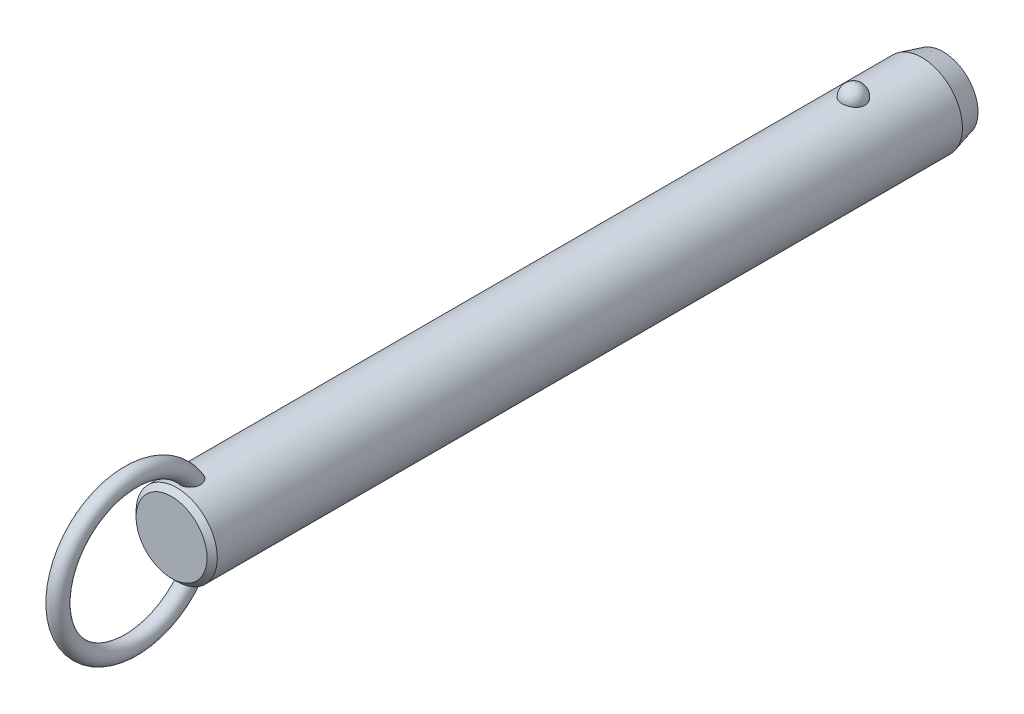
ISO-10303-21;
HEADER;
FILE_DESCRIPTION(('STEP AP214'),'2;1');
FILE_NAME('part.step','',(''),(''),'','','');
FILE_SCHEMA(('AUTOMOTIVE_DESIGN { 1 0 10303 214 1 1 1 1 }'));
ENDSEC;
DATA;
#1=APPLICATION_CONTEXT('core data for automotive mechanical design processes');
#2=APPLICATION_PROTOCOL_DEFINITION('international standard','automotive_design',2000,#1);
#3=PRODUCT_CONTEXT('',#1,'mechanical');
#4=PRODUCT('Part','Part','',(#3));
#5=PRODUCT_RELATED_PRODUCT_CATEGORY('part','',(#4));
#6=PRODUCT_DEFINITION_FORMATION('','',#4);
#7=PRODUCT_DEFINITION_CONTEXT('part definition',#1,'design');
#8=PRODUCT_DEFINITION('design','',#6,#7);
#9=PRODUCT_DEFINITION_SHAPE('','',#8);
#10=(LENGTH_UNIT() NAMED_UNIT(*) SI_UNIT(.MILLI.,.METRE.));
#11=(NAMED_UNIT(*) PLANE_ANGLE_UNIT() SI_UNIT($,.RADIAN.));
#12=(NAMED_UNIT(*) SI_UNIT($,.STERADIAN.) SOLID_ANGLE_UNIT());
#13=UNCERTAINTY_MEASURE_WITH_UNIT(LENGTH_MEASURE(1.E-05),#10,'distance_accuracy_value','');
#14=(GEOMETRIC_REPRESENTATION_CONTEXT(3) GLOBAL_UNCERTAINTY_ASSIGNED_CONTEXT((#13)) GLOBAL_UNIT_ASSIGNED_CONTEXT((#10,
#11,#12)) REPRESENTATION_CONTEXT('',''));
#15=CARTESIAN_POINT('',(0.,0.,0.));
#16=DIRECTION('',(0.,0.,1.));
#17=DIRECTION('',(1.,0.,0.));
#18=AXIS2_PLACEMENT_3D('',#15,#16,#17);
#19=CARTESIAN_POINT('',(0.,0.,147.3));
#20=DIRECTION('',(0.,0.,-1.));
#21=DIRECTION('',(-1.,0.,0.));
#22=AXIS2_PLACEMENT_3D('',#19,#20,#21);
#23=CYLINDRICAL_SURFACE('',#22,9.5);
#24=CARTESIAN_POINT('',(2.67259918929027,9.11631578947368,-2.70000000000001));
#25=CARTESIAN_POINT('',(2.6725968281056,9.11631786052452,-2.54909854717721));
#26=CARTESIAN_POINT('',(2.66030567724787,9.11994722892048,-2.39816735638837));
#27=CARTESIAN_POINT('',(2.6114347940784,9.13405924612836,-2.10058568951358));
#28=CARTESIAN_POINT('',(2.57484658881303,9.14454428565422,-1.95393672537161));
#29=CARTESIAN_POINT('',(2.47830875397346,9.17117631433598,-1.66916069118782));
#30=CARTESIAN_POINT('',(2.41836936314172,9.18732082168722,-1.53102991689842));
#31=CARTESIAN_POINT('',(2.27661331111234,9.22346780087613,-1.26705393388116));
#32=CARTESIAN_POINT('',(2.19479699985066,9.24347021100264,-1.14120852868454));
#33=CARTESIAN_POINT('',(2.01085282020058,9.28522401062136,-0.904632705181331));
#34=CARTESIAN_POINT('',(1.90862396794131,9.30698376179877,-0.793982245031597));
#35=CARTESIAN_POINT('',(1.6867437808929,9.34973971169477,-0.591607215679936));
#36=CARTESIAN_POINT('',(1.56709244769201,9.37073591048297,-0.499882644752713));
#37=CARTESIAN_POINT('',(1.31393976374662,9.40956370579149,-0.338167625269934));
#38=CARTESIAN_POINT('',(1.18048026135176,9.42740444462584,-0.268113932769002));
#39=CARTESIAN_POINT('',(0.903154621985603,9.45799906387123,-0.151390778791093));
#40=CARTESIAN_POINT('',(0.759289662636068,9.47075351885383,-0.104718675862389));
#41=CARTESIAN_POINT('',(0.468074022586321,9.48956256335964,-0.0367633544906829));
#42=CARTESIAN_POINT('',(0.320836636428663,9.49573643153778,-0.0150275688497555));
#43=CARTESIAN_POINT('',(0.0246714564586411,9.50112183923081,0.00396199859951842));
#44=CARTESIAN_POINT('',(-0.124256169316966,9.50033406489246,0.00121819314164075));
#45=CARTESIAN_POINT('',(-0.417264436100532,9.4919475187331,-0.0284441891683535));
#46=CARTESIAN_POINT('',(-0.56138413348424,9.48444885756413,-0.0550074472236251));
#47=CARTESIAN_POINT('',(-0.842986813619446,9.46357853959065,-0.131064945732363));
#48=CARTESIAN_POINT('',(-0.980469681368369,9.450206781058,-0.180559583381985));
#49=CARTESIAN_POINT('',(-1.24585005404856,9.41890822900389,-0.301476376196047));
#50=CARTESIAN_POINT('',(-1.37368611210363,9.40095498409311,-0.373026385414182));
#51=CARTESIAN_POINT('',(-1.61552738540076,9.36242964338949,-0.536025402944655));
#52=CARTESIAN_POINT('',(-1.72953116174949,9.34185727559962,-0.627476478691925));
#53=CARTESIAN_POINT('',(-1.9429225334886,9.29984568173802,-0.829844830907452));
#54=CARTESIAN_POINT('',(-2.04198021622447,9.27839736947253,-0.94110821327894));
#55=CARTESIAN_POINT('',(-2.22026460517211,9.23735994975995,-1.17883414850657));
#56=CARTESIAN_POINT('',(-2.29948985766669,9.21777097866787,-1.30529781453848));
#57=CARTESIAN_POINT('',(-2.43697287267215,9.18238994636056,-1.57158566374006));
#58=CARTESIAN_POINT('',(-2.49497068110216,9.16664569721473,-1.71155057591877));
#59=CARTESIAN_POINT('',(-2.5872073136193,9.14104303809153,-1.99961197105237));
#60=CARTESIAN_POINT('',(-2.62144683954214,9.13118445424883,-2.14770821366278));
#61=CARTESIAN_POINT('',(-2.66521466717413,9.11850622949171,-2.44715424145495));
#62=CARTESIAN_POINT('',(-2.67484831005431,9.11565658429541,-2.59848735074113));
#63=CARTESIAN_POINT('',(-2.66946735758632,9.11723375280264,-2.90067317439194));
#64=CARTESIAN_POINT('',(-2.65445345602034,9.12166036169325,-3.05152590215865));
#65=CARTESIAN_POINT('',(-2.60029711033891,9.13724422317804,-3.34766110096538));
#66=CARTESIAN_POINT('',(-2.56127978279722,9.14836656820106,-3.49296833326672));
#67=CARTESIAN_POINT('',(-2.46018844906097,9.17606676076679,-3.77477535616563));
#68=CARTESIAN_POINT('',(-2.39811349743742,9.1926448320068,-3.9112747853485));
#69=CARTESIAN_POINT('',(-2.25202303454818,9.22952198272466,-4.17244273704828));
#70=CARTESIAN_POINT('',(-2.16788714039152,9.24984129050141,-4.29704106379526));
#71=CARTESIAN_POINT('',(-1.9799408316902,9.29188255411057,-4.53013066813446));
#72=CARTESIAN_POINT('',(-1.87612963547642,9.31360456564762,-4.63862130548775));
#73=CARTESIAN_POINT('',(-1.65105429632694,9.35612959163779,-4.8369029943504));
#74=CARTESIAN_POINT('',(-1.52972405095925,9.37692871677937,-4.92661991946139));
#75=CARTESIAN_POINT('',(-1.27318250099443,9.41518970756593,-5.08429106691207));
#76=CARTESIAN_POINT('',(-1.13797219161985,9.432651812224,-5.15224684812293));
#77=CARTESIAN_POINT('',(-0.859280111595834,9.46208255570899,-5.26371827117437));
#78=CARTESIAN_POINT('',(-0.715925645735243,9.47411833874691,-5.30753421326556));
#79=CARTESIAN_POINT('',(-0.423550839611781,9.4916822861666,-5.37076321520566));
#80=CARTESIAN_POINT('',(-0.2745312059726,9.49721125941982,-5.39017930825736));
#81=CARTESIAN_POINT('',(0.0218446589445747,9.50110860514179,-5.40390587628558));
#82=CARTESIAN_POINT('',(0.16917707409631,9.49961381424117,-5.39869609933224));
#83=CARTESIAN_POINT('',(0.460808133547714,9.48993906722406,-5.36441955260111));
#84=CARTESIAN_POINT('',(0.605106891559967,9.48175936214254,-5.33535367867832));
#85=CARTESIAN_POINT('',(0.886027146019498,9.4596376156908,-5.25435587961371));
#86=CARTESIAN_POINT('',(1.02267710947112,9.44571881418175,-5.20251612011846));
#87=CARTESIAN_POINT('',(1.28523827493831,9.41358993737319,-5.07741549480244));
#88=CARTESIAN_POINT('',(1.41114877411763,9.39537958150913,-5.00415322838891));
#89=CARTESIAN_POINT('',(1.65085227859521,9.3562644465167,-4.83684599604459));
#90=CARTESIAN_POINT('',(1.76442346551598,9.33532178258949,-4.74249218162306));
#91=CARTESIAN_POINT('',(1.97425672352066,9.29321198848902,-4.53620389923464));
#92=CARTESIAN_POINT('',(2.07051582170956,9.27204482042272,-4.42426641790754));
#93=CARTESIAN_POINT('',(2.24490086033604,9.23139221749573,-4.18363183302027));
#94=CARTESIAN_POINT('',(2.32267019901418,9.21194380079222,-4.05466990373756));
#95=CARTESIAN_POINT('',(2.45584092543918,9.1773419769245,-3.78517836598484));
#96=CARTESIAN_POINT('',(2.5112497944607,9.16218713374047,-3.64465264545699));
#97=CARTESIAN_POINT('',(2.59380876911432,9.13913522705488,-3.37104301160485));
#98=CARTESIAN_POINT('',(2.62330266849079,9.13064624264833,-3.23871053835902));
#99=CARTESIAN_POINT('',(2.66269870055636,9.11923566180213,-2.97092664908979));
#100=CARTESIAN_POINT('',(2.67260130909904,9.11631393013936,-2.83547530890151));
#101=CARTESIAN_POINT('',(2.67259918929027,9.11631578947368,-2.70000000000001));
#102=B_SPLINE_CURVE_WITH_KNOTS('',3,(#24,#25,#26,#27,#28,#29,#30,#31,#32,#33,#34,#35,#36,#37,
#38,#39,#40,#41,#42,#43,#44,#45,#46,#47,#48,#49,#50,#51,#52,#53,#54,#55,#56,#57,#58,#59,#60,#61,
#62,#63,#64,#65,#66,#67,#68,#69,#70,#71,#72,#73,#74,#75,#76,#77,#78,#79,#80,#81,#82,#83,#84,#85,
#86,#87,#88,#89,#90,#91,#92,#93,#94,#95,#96,#97,#98,#99,#100,#101),.UNSPECIFIED.,.T.,.F.,(4,2,2,
2,2,2,2,2,2,2,2,2,2,2,2,2,2,2,2,2,2,2,2,2,2,2,2,2,2,2,2,2,2,2,2,2,2,2,4),(0.,0.452217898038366,
0.904593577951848,1.35677112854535,1.80894144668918,2.26340676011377,2.71787203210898,
3.17099820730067,3.62407318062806,4.0687883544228,4.51345969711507,4.95160616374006,
5.38976021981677,5.83050358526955,6.27129275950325,6.72071308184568,7.17016633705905,
7.62495278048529,8.07972578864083,8.53254856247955,8.98535859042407,9.43582813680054,
9.88631615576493,10.3393155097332,10.7923328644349,11.2471065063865,11.7018475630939,
12.150795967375,12.599688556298,13.0398725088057,13.4800399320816,13.9184421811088,
14.3568730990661,14.802202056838,15.2476074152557,15.7010097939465,16.1542603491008,
16.5602594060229,16.966248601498),.UNSPECIFIED.);
#103=CARTESIAN_POINT('',(2.67259918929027,9.11631578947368,-2.70000000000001));
#104=VERTEX_POINT('',#103);
#105=EDGE_CURVE('E41',#104,#104,#102,.T.);
#106=ORIENTED_EDGE('',*,*,#105,.T.);
#107=EDGE_LOOP('',(#106));
#108=FACE_BOUND('',#107,.T.);
#109=CARTESIAN_POINT('',(0.,0.,155.62));
#110=DIRECTION('',(0.,0.,1.));
#111=DIRECTION('',(1.,0.,0.));
#112=AXIS2_PLACEMENT_3D('',#109,#110,#111);
#113=CIRCLE('',#112,9.5);
#114=CARTESIAN_POINT('',(9.5,0.,155.62));
#115=VERTEX_POINT('',#114);
#116=EDGE_CURVE('E10',#115,#115,#113,.F.);
#117=ORIENTED_EDGE('',*,*,#116,.T.);
#118=EDGE_LOOP('',(#117));
#119=FACE_BOUND('',#118,.T.);
#120=CARTESIAN_POINT('',(-0.697062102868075,-9.47439269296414,149.967808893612));
#121=CARTESIAN_POINT('',(-0.799579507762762,-9.46685146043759,150.007482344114));
#122=CARTESIAN_POINT('',(-0.898575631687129,-9.45788043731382,150.0559309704));
#123=CARTESIAN_POINT('',(-1.08670047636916,-9.43811593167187,150.168868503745));
#124=CARTESIAN_POINT('',(-1.17583204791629,-9.42732297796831,150.233352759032));
#125=CARTESIAN_POINT('',(-1.34179806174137,-9.40513672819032,150.376209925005));
#126=CARTESIAN_POINT('',(-1.41865133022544,-9.39374438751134,150.454561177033));
#127=CARTESIAN_POINT('',(-1.55860047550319,-9.37154196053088,150.622752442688));
#128=CARTESIAN_POINT('',(-1.62169476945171,-9.3607319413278,150.71259377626));
#129=CARTESIAN_POINT('',(-1.73527695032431,-9.34035749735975,150.904500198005));
#130=CARTESIAN_POINT('',(-1.78522266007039,-9.33085270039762,151.006891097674));
#131=CARTESIAN_POINT('',(-1.86924997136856,-9.3143834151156,151.218148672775));
#132=CARTESIAN_POINT('',(-1.90332570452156,-9.30741986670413,151.327017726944));
#133=CARTESIAN_POINT('',(-1.95893603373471,-9.29588482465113,151.560473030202));
#134=CARTESIAN_POINT('',(-1.97872420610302,-9.29165182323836,151.685489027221));
#135=CARTESIAN_POINT('',(-2.00062129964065,-9.28695978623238,151.937080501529));
#136=CARTESIAN_POINT('',(-2.00272284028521,-9.28650232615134,152.063656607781));
#137=CARTESIAN_POINT('',(-1.98958876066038,-9.28932750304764,152.336815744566));
#138=CARTESIAN_POINT('',(-1.97143366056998,-9.2932400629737,152.483251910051));
#139=CARTESIAN_POINT('',(-1.91479925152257,-9.30507151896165,152.772062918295));
#140=CARTESIAN_POINT('',(-1.87629122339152,-9.31299607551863,152.914431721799));
#141=CARTESIAN_POINT('',(-1.77225683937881,-9.33340232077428,153.215172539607));
#142=CARTESIAN_POINT('',(-1.70334898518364,-9.34641636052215,153.372369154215));
#143=CARTESIAN_POINT('',(-1.58111062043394,-9.36759153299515,153.597517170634));
#144=CARTESIAN_POINT('',(-1.53721459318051,-9.37492619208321,153.670796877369));
#145=CARTESIAN_POINT('',(-1.44302631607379,-9.38988566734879,153.81307405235));
#146=CARTESIAN_POINT('',(-1.39273721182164,-9.39751033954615,153.882073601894));
#147=CARTESIAN_POINT('',(-1.26775962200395,-9.41530678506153,154.036983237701));
#148=CARTESIAN_POINT('',(-1.19052326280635,-9.42548108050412,154.120871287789));
#149=CARTESIAN_POINT('',(-1.02420241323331,-9.44499825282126,154.276008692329));
#150=CARTESIAN_POINT('',(-0.935139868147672,-9.45434261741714,154.347280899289));
#151=CARTESIAN_POINT('',(-0.76661041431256,-9.46930670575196,154.458695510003));
#152=CARTESIAN_POINT('',(-0.689439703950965,-9.47529223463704,154.502235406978));
#153=CARTESIAN_POINT('',(-0.528942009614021,-9.48560294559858,154.57631336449));
#154=CARTESIAN_POINT('',(-0.445620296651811,-9.48992953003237,154.606862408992));
#155=CARTESIAN_POINT('',(-0.273901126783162,-9.49644161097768,154.652579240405));
#156=CARTESIAN_POINT('',(-0.18546574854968,-9.49860811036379,154.66761059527));
#157=CARTESIAN_POINT('',(-0.00734541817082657,-9.5004135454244,154.680149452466));
#158=CARTESIAN_POINT('',(0.082338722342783,-9.50005405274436,154.677667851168));
#159=CARTESIAN_POINT('',(0.247679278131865,-9.49708301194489,154.656995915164));
#160=CARTESIAN_POINT('',(0.323620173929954,-9.49477609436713,154.640930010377));
#161=CARTESIAN_POINT('',(0.471981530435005,-9.48855917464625,154.597172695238));
#162=CARTESIAN_POINT('',(0.544400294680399,-9.48464840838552,154.569475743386));
#163=CARTESIAN_POINT('',(0.708947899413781,-9.47398336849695,154.49280266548));
#164=CARTESIAN_POINT('',(0.799149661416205,-9.46671310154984,154.439774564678));
#165=CARTESIAN_POINT('',(0.969783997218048,-9.45076225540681,154.319973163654));
#166=CARTESIAN_POINT('',(1.05019415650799,-9.44207854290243,154.253169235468));
#167=CARTESIAN_POINT('',(1.23092343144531,-9.42051459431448,154.080759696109));
#168=CARTESIAN_POINT('',(1.32652499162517,-9.40733378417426,153.97026193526));
#169=CARTESIAN_POINT('',(1.49893121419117,-9.38140745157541,153.735561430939));
#170=CARTESIAN_POINT('',(1.57571616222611,-9.36866239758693,153.611344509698));
#171=CARTESIAN_POINT('',(1.71285426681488,-9.34457644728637,153.349389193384));
#172=CARTESIAN_POINT('',(1.77266365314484,-9.33328726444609,153.21136233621));
#173=CARTESIAN_POINT('',(1.87239208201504,-9.31379209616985,152.928051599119));
#174=CARTESIAN_POINT('',(1.91230158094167,-9.30558759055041,152.782764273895));
#175=CARTESIAN_POINT('',(1.97604189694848,-9.29228394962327,152.462028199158));
#176=CARTESIAN_POINT('',(1.9958743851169,-9.28797202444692,152.285724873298));
#177=CARTESIAN_POINT('',(2.00295708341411,-9.28645519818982,151.932414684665));
#178=CARTESIAN_POINT('',(1.99025930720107,-9.28923895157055,151.755409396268));
#179=CARTESIAN_POINT('',(1.93735479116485,-9.30038134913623,151.456338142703));
#180=CARTESIAN_POINT('',(1.90576827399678,-9.30697680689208,151.332667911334));
#181=CARTESIAN_POINT('',(1.82287484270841,-9.32356855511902,151.092329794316));
#182=CARTESIAN_POINT('',(1.77158213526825,-9.33356239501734,150.975656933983));
#183=CARTESIAN_POINT('',(1.64885744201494,-9.35602275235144,150.752706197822));
#184=CARTESIAN_POINT('',(1.57730995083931,-9.36850332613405,150.646492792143));
#185=CARTESIAN_POINT('',(1.41543264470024,-9.39431873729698,150.449553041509));
#186=CARTESIAN_POINT('',(1.32510883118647,-9.40765330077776,150.358821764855));
#187=CARTESIAN_POINT('',(1.13846223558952,-9.43195720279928,150.205033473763));
#188=CARTESIAN_POINT('',(1.04369890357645,-9.44302894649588,150.140094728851));
#189=CARTESIAN_POINT('',(0.843965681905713,-9.46296805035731,150.028038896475));
#190=CARTESIAN_POINT('',(0.739000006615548,-9.47183631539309,149.980914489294));
#191=CARTESIAN_POINT('',(0.528175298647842,-9.48586140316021,149.908117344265));
#192=CARTESIAN_POINT('',(0.422686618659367,-9.49119633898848,149.88140249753));
#193=CARTESIAN_POINT('',(0.208590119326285,-9.49831365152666,149.846013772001));
#194=CARTESIAN_POINT('',(0.0999817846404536,-9.500095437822,149.837342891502));
#195=CARTESIAN_POINT('',(-0.126104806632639,-9.49988861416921,149.838350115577));
#196=CARTESIAN_POINT('',(-0.243578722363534,-9.49757821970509,149.849594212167));
#197=CARTESIAN_POINT('',(-0.474390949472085,-9.48885165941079,149.893167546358));
#198=CARTESIAN_POINT('',(-0.587729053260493,-9.48243528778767,149.925497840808));
#199=CARTESIAN_POINT('',(-0.697062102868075,-9.47439269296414,149.967808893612));
#200=B_SPLINE_CURVE_WITH_KNOTS('',3,(#120,#121,#122,#123,#124,#125,#126,#127,#128,#129,#130,
#131,#132,#133,#134,#135,#136,#137,#138,#139,#140,#141,#142,#143,#144,#145,#146,#147,#148,#149,
#150,#151,#152,#153,#154,#155,#156,#157,#158,#159,#160,#161,#162,#163,#164,#165,#166,#167,#168,
#169,#170,#171,#172,#173,#174,#175,#176,#177,#178,#179,#180,#181,#182,#183,#184,#185,#186,#187,
#188,#189,#190,#191,#192,#193,#194,#195,#196,#197,#198,#199),.UNSPECIFIED.,.T.,.F.,(4,2,2,2,2,2,
2,2,2,2,2,2,2,2,2,2,2,2,2,2,2,2,2,2,2,2,2,2,2,2,2,2,2,2,2,2,2,2,2,4),(0.,0.330119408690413,
0.6601431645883,0.98965593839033,1.31920659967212,1.660747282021,2.00241415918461,
2.3808869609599,2.75951768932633,3.20065679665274,3.64242004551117,4.15620996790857,
4.41314162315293,4.66994734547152,5.0122866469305,5.35399933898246,5.61943037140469,
5.88463652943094,6.15215502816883,6.41950709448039,6.65144391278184,6.88349136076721,
7.19641200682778,7.51003602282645,7.94779711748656,8.3860149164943,8.83699707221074,
9.28819530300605,9.81778662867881,10.34653170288,10.7284172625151,11.1100280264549,
11.4938603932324,11.8775702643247,12.2220189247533,12.5663259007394,12.8915939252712,
13.2169159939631,13.5689650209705,13.9210316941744),.UNSPECIFIED.);
#201=CARTESIAN_POINT('',(-0.697062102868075,-9.47439269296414,149.967808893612));
#202=VERTEX_POINT('',#201);
#203=EDGE_CURVE('E60',#202,#202,#200,.T.);
#204=ORIENTED_EDGE('',*,*,#203,.T.);
#205=EDGE_LOOP('',(#204));
#206=FACE_BOUND('',#205,.T.);
#207=CARTESIAN_POINT('',(-0.697062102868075,9.47439269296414,149.967808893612));
#208=CARTESIAN_POINT('',(-0.597792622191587,9.48169483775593,149.92939564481));
#209=CARTESIAN_POINT('',(-0.495106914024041,9.48766580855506,149.899168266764));
#210=CARTESIAN_POINT('',(-0.285876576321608,9.49627648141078,149.856032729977));
#211=CARTESIAN_POINT('',(-0.179324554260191,9.49890941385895,149.843159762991));
#212=CARTESIAN_POINT('',(0.0344157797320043,9.50053798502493,149.835166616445));
#213=CARTESIAN_POINT('',(0.14160360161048,9.49953613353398,149.840034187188));
#214=CARTESIAN_POINT('',(0.353563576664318,9.49401038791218,149.867365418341));
#215=CARTESIAN_POINT('',(0.458336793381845,9.48948807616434,149.88982117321));
#216=CARTESIAN_POINT('',(0.662493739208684,9.4774236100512,149.951671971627));
#217=CARTESIAN_POINT('',(0.761881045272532,9.46988348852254,149.991055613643));
#218=CARTESIAN_POINT('',(0.952608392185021,9.45260382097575,150.085634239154));
#219=CARTESIAN_POINT('',(1.04394806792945,9.44286417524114,150.140829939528));
#220=CARTESIAN_POINT('',(1.21712767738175,9.42211760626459,150.266066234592));
#221=CARTESIAN_POINT('',(1.29885671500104,9.41109835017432,150.336257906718));
#222=CARTESIAN_POINT('',(1.44978975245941,9.38903310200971,150.488980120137));
#223=CARTESIAN_POINT('',(1.51899278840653,9.37798710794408,150.571511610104));
#224=CARTESIAN_POINT('',(1.64602857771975,9.35654375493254,150.749776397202));
#225=CARTESIAN_POINT('',(1.70333052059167,9.34618688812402,150.845891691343));
#226=CARTESIAN_POINT('',(1.80259341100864,9.32755128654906,151.045897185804));
#227=CARTESIAN_POINT('',(1.84454942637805,9.31927322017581,151.149789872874));
#228=CARTESIAN_POINT('',(1.91637039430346,9.30478365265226,151.372213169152));
#229=CARTESIAN_POINT('',(1.944805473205,9.29882552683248,151.491219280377));
#230=CARTESIAN_POINT('',(1.98449865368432,9.29043398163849,151.732143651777));
#231=CARTESIAN_POINT('',(1.99574908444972,9.28800213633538,151.854063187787));
#232=CARTESIAN_POINT('',(2.00275141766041,9.28649645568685,152.116932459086));
#233=CARTESIAN_POINT('',(1.99588238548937,9.28799035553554,152.257952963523));
#234=CARTESIAN_POINT('',(1.96270559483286,9.29505517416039,152.537621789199));
#235=CARTESIAN_POINT('',(1.93637872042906,9.30063010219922,152.676267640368));
#236=CARTESIAN_POINT('',(1.85949176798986,9.31633564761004,152.972561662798));
#237=CARTESIAN_POINT('',(1.80549792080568,9.3270926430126,153.129290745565));
#238=CARTESIAN_POINT('',(1.67376869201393,9.3516306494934,153.432284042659));
#239=CARTESIAN_POINT('',(1.59603181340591,9.36541185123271,153.578547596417));
#240=CARTESIAN_POINT('',(1.4360277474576,9.39110706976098,153.825813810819));
#241=CARTESIAN_POINT('',(1.35831795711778,9.40278656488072,153.929791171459));
#242=CARTESIAN_POINT('',(1.18774483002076,9.42585025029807,154.124534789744));
#243=CARTESIAN_POINT('',(1.09490932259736,9.43723493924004,154.215324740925));
#244=CARTESIAN_POINT('',(0.921110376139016,9.45552616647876,154.35620334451));
#245=CARTESIAN_POINT('',(0.843738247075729,9.46281058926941,154.410656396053));
#246=CARTESIAN_POINT('',(0.681245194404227,9.47589120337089,154.506711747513));
#247=CARTESIAN_POINT('',(0.596135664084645,9.48168953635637,154.548332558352));
#248=CARTESIAN_POINT('',(0.433779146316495,9.49038144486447,154.610089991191));
#249=CARTESIAN_POINT('',(0.35745955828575,9.49359170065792,154.63260136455));
#250=CARTESIAN_POINT('',(0.202074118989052,9.49816761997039,154.664574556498));
#251=CARTESIAN_POINT('',(0.123010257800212,9.49953459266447,154.674045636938));
#252=CARTESIAN_POINT('',(-0.0357372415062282,9.50026497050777,154.679114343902));
#253=CARTESIAN_POINT('',(-0.115421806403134,9.49962433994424,154.674684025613));
#254=CARTESIAN_POINT('',(-0.272823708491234,9.49640854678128,154.652296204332));
#255=CARTESIAN_POINT('',(-0.350540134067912,9.4938325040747,154.634332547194));
#256=CARTESIAN_POINT('',(-0.500580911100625,9.48709462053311,154.586802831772));
#257=CARTESIAN_POINT('',(-0.572979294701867,9.48296359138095,154.557461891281));
#258=CARTESIAN_POINT('',(-0.71286452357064,9.47347609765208,154.489008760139));
#259=CARTESIAN_POINT('',(-0.780349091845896,9.46811906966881,154.449892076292));
#260=CARTESIAN_POINT('',(-0.946309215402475,9.45329720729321,154.339432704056));
#261=CARTESIAN_POINT('',(-1.04090230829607,9.44321512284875,154.262329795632));
#262=CARTESIAN_POINT('',(-1.21661929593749,9.42219227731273,154.09409718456));
#263=CARTESIAN_POINT('',(-1.29770519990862,9.41124921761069,154.002929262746));
#264=CARTESIAN_POINT('',(-1.47319646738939,9.38563439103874,153.776162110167));
#265=CARTESIAN_POINT('',(-1.5620887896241,9.37102009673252,153.636289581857));
#266=CARTESIAN_POINT('',(-1.71623987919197,9.34401559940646,153.343950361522));
#267=CARTESIAN_POINT('',(-1.7814786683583,9.33162728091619,153.191473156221));
#268=CARTESIAN_POINT('',(-1.88853837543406,9.31055541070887,152.875647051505));
#269=CARTESIAN_POINT('',(-1.92998995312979,9.30193076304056,152.712168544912));
#270=CARTESIAN_POINT('',(-1.98590726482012,9.29015757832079,152.380526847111));
#271=CARTESIAN_POINT('',(-2.0004070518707,9.2870021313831,152.212369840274));
#272=CARTESIAN_POINT('',(-1.99964701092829,9.28716218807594,151.905080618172));
#273=CARTESIAN_POINT('',(-1.98908145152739,9.28945704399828,151.765936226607));
#274=CARTESIAN_POINT('',(-1.94566294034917,9.29865169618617,151.491153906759));
#275=CARTESIAN_POINT('',(-1.91282062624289,9.30554929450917,151.355514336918));
#276=CARTESIAN_POINT('',(-1.84582133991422,9.31898248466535,151.157802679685));
#277=CARTESIAN_POINT('',(-1.82038084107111,9.32400364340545,151.092583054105));
#278=CARTESIAN_POINT('',(-1.7635051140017,9.33492884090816,150.964903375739));
#279=CARTESIAN_POINT('',(-1.73207305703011,9.34083241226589,150.902441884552));
#280=CARTESIAN_POINT('',(-1.66324243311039,9.35333332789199,150.78094078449));
#281=CARTESIAN_POINT('',(-1.625842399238,9.35993084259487,150.721902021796));
#282=CARTESIAN_POINT('',(-1.54527678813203,9.37356864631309,150.607987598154));
#283=CARTESIAN_POINT('',(-1.50211241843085,9.38060884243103,150.553111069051));
#284=CARTESIAN_POINT('',(-1.37681147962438,9.40004442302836,150.409961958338));
#285=CARTESIAN_POINT('',(-1.28916358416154,9.41261047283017,150.326429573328));
#286=CARTESIAN_POINT('',(-1.09996826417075,9.43658180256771,150.177236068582));
#287=CARTESIAN_POINT('',(-0.998461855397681,9.44799034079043,150.111523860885));
#288=CARTESIAN_POINT('',(-0.860188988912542,9.46103017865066,150.0394367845));
#289=CARTESIAN_POINT('',(-0.828141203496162,9.46389141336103,150.023851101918));
#290=CARTESIAN_POINT('',(-0.763210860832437,9.46934915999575,149.994473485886));
#291=CARTESIAN_POINT('',(-0.730328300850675,9.47194567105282,149.980681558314));
#292=CARTESIAN_POINT('',(-0.697062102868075,9.47439269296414,149.967808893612));
#293=B_SPLINE_CURVE_WITH_KNOTS('',3,(#207,#208,#209,#210,#211,#212,#213,#214,#215,#216,#217,
#218,#219,#220,#221,#222,#223,#224,#225,#226,#227,#228,#229,#230,#231,#232,#233,#234,#235,#236,
#237,#238,#239,#240,#241,#242,#243,#244,#245,#246,#247,#248,#249,#250,#251,#252,#253,#254,#255,
#256,#257,#258,#259,#260,#261,#262,#263,#264,#265,#266,#267,#268,#269,#270,#271,#272,#273,#274,
#275,#276,#277,#278,#279,#280,#281,#282,#283,#284,#285,#286,#287,#288,#289,#290,#291,#292),
.UNSPECIFIED.,.T.,.F.,(4,2,2,2,2,2,2,2,2,2,2,2,2,2,2,2,2,2,2,2,2,2,2,2,2,2,2,2,2,2,2,2,2,2,2,2,
2,2,2,2,2,2,4),(0.,0.319942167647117,0.640532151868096,0.960900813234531,1.28112555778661,
1.60113495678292,1.92115886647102,2.24457323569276,2.56801248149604,2.90371927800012,
3.23953387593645,3.60560313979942,3.97183576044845,4.39383693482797,4.81625324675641,
5.31257045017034,5.80891895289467,6.19868344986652,6.58773876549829,6.87145417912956,
7.15475838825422,7.39263751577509,7.63034760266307,7.86853584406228,8.10683246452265,
8.3406366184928,8.57454843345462,8.93983939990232,9.30614105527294,9.8026666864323,
10.2996107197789,10.8040753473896,11.3079021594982,11.7249776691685,12.1418541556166,
12.3521485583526,12.5623319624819,12.7725671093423,12.9827582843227,13.345827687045,
13.7078449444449,13.8150604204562,13.9222762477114),.UNSPECIFIED.);
#294=CARTESIAN_POINT('',(-0.697062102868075,9.47439269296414,149.967808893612));
#295=VERTEX_POINT('',#294);
#296=EDGE_CURVE('E67',#295,#295,#293,.T.);
#297=ORIENTED_EDGE('',*,*,#296,.T.);
#298=EDGE_LOOP('',(#297));
#299=FACE_BOUND('',#298,.T.);
#300=CARTESIAN_POINT('',(0.,0.,-18.6999999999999));
#301=DIRECTION('',(0.,0.,-1.));
#302=DIRECTION('',(-1.,0.,0.));
#303=AXIS2_PLACEMENT_3D('',#300,#301,#302);
#304=CIRCLE('',#303,9.5);
#305=CARTESIAN_POINT('',(-9.5,0.,-18.6999999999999));
#306=VERTEX_POINT('',#305);
#307=EDGE_CURVE('E57',#306,#306,#304,.F.);
#308=ORIENTED_EDGE('',*,*,#307,.T.);
#309=EDGE_LOOP('',(#308));
#310=FACE_BOUND('',#309,.T.);
#311=ADVANCED_FACE('F37',(#108,#119,#206,#299,#310),#23,.T.);
#312=CARTESIAN_POINT('',(0.,0.,-23.7));
#313=DIRECTION('',(0.,0.,-1.));
#314=DIRECTION('',(-1.,0.,0.));
#315=AXIS2_PLACEMENT_3D('',#312,#313,#314);
#316=PLANE('',#315);
#317=CARTESIAN_POINT('',(0.,0.,-23.7));
#318=DIRECTION('',(0.,0.,-1.));
#319=DIRECTION('',(-1.,0.,0.));
#320=AXIS2_PLACEMENT_3D('',#317,#318,#319);
#321=CIRCLE('',#320,8.16025403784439);
#322=CARTESIAN_POINT('',(-8.16025403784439,0.,-23.7));
#323=VERTEX_POINT('',#322);
#324=EDGE_CURVE('E66',#323,#323,#321,.T.);
#325=ORIENTED_EDGE('',*,*,#324,.T.);
#326=EDGE_LOOP('',(#325));
#327=FACE_BOUND('',#326,.T.);
#328=ADVANCED_FACE('F85',(#327),#316,.T.);
#329=CARTESIAN_POINT('',(0.,0.,-23.7));
#330=DIRECTION('',(0.,0.,1.));
#331=DIRECTION('',(1.,0.,0.));
#332=AXIS2_PLACEMENT_3D('',#329,#330,#331);
#333=CONICAL_SURFACE('',#332,8.16025403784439,0.261799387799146);
#334=ORIENTED_EDGE('',*,*,#307,.F.);
#335=EDGE_LOOP('',(#334));
#336=FACE_BOUND('',#335,.T.);
#337=ORIENTED_EDGE('',*,*,#324,.F.);
#338=EDGE_LOOP('',(#337));
#339=FACE_BOUND('',#338,.T.);
#340=ADVANCED_FACE('F83',(#336,#339),#333,.T.);
#341=CARTESIAN_POINT('',(0.,0.,156.82));
#342=DIRECTION('',(0.,0.,1.));
#343=DIRECTION('',(1.,0.,0.));
#344=AXIS2_PLACEMENT_3D('',#341,#342,#343);
#345=PLANE('',#344);
#346=CARTESIAN_POINT('',(0.,0.,156.82));
#347=DIRECTION('',(0.,0.,1.));
#348=DIRECTION('',(1.,0.,0.));
#349=AXIS2_PLACEMENT_3D('',#346,#347,#348);
#350=CIRCLE('',#349,8.30000000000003);
#351=CARTESIAN_POINT('',(8.30000000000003,0.,156.82));
#352=VERTEX_POINT('',#351);
#353=EDGE_CURVE('E50',#352,#352,#350,.T.);
#354=ORIENTED_EDGE('',*,*,#353,.T.);
#355=EDGE_LOOP('',(#354));
#356=FACE_BOUND('',#355,.T.);
#357=ADVANCED_FACE('F77',(#356),#345,.T.);
#358=CARTESIAN_POINT('',(0.,0.,166.35));
#359=DIRECTION('',(1.,0.,0.));
#360=DIRECTION('',(0.,0.,-1.));
#361=AXIS2_PLACEMENT_3D('',#358,#359,#360);
#362=TOROIDAL_SURFACE('',#361,17.05,2.);
#363=ORIENTED_EDGE('',*,*,#296,.F.);
#364=EDGE_LOOP('',(#363));
#365=FACE_BOUND('',#364,.T.);
#366=ORIENTED_EDGE('',*,*,#203,.F.);
#367=EDGE_LOOP('',(#366));
#368=FACE_BOUND('',#367,.T.);
#369=ADVANCED_FACE('F73',(#365,#368),#362,.T.);
#370=CARTESIAN_POINT('',(0.,0.,156.82));
#371=DIRECTION('',(0.,0.,-1.));
#372=DIRECTION('',(-1.,0.,0.));
#373=AXIS2_PLACEMENT_3D('',#370,#371,#372);
#374=CONICAL_SURFACE('',#373,8.30000000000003,0.785398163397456);
#375=ORIENTED_EDGE('',*,*,#116,.F.);
#376=EDGE_LOOP('',(#375));
#377=FACE_BOUND('',#376,.T.);
#378=ORIENTED_EDGE('',*,*,#353,.F.);
#379=EDGE_LOOP('',(#378));
#380=FACE_BOUND('',#379,.T.);
#381=ADVANCED_FACE('F39',(#377,#380),#374,.T.);
#382=CARTESIAN_POINT('',(0.,9.5,-2.70000000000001));
#383=DIRECTION('',(0.,1.,0.));
#384=DIRECTION('',(0.,0.,-1.));
#385=AXIS2_PLACEMENT_3D('',#382,#383,#384);
#386=SPHERICAL_SURFACE('',#385,2.7);
#387=ORIENTED_EDGE('',*,*,#105,.F.);
#388=EDGE_LOOP('',(#387));
#389=FACE_BOUND('',#388,.T.);
#390=ADVANCED_FACE('F79',(#389),#386,.T.);
#391=CLOSED_SHELL('',(#311,#328,#340,#357,#369,#381,#390));
#392=MANIFOLD_SOLID_BREP('B2',#391);
#393=ADVANCED_BREP_SHAPE_REPRESENTATION('',(#18,#392),#14);
#394=SHAPE_DEFINITION_REPRESENTATION(#9,#393);
ENDSEC;
END-ISO-10303-21;
